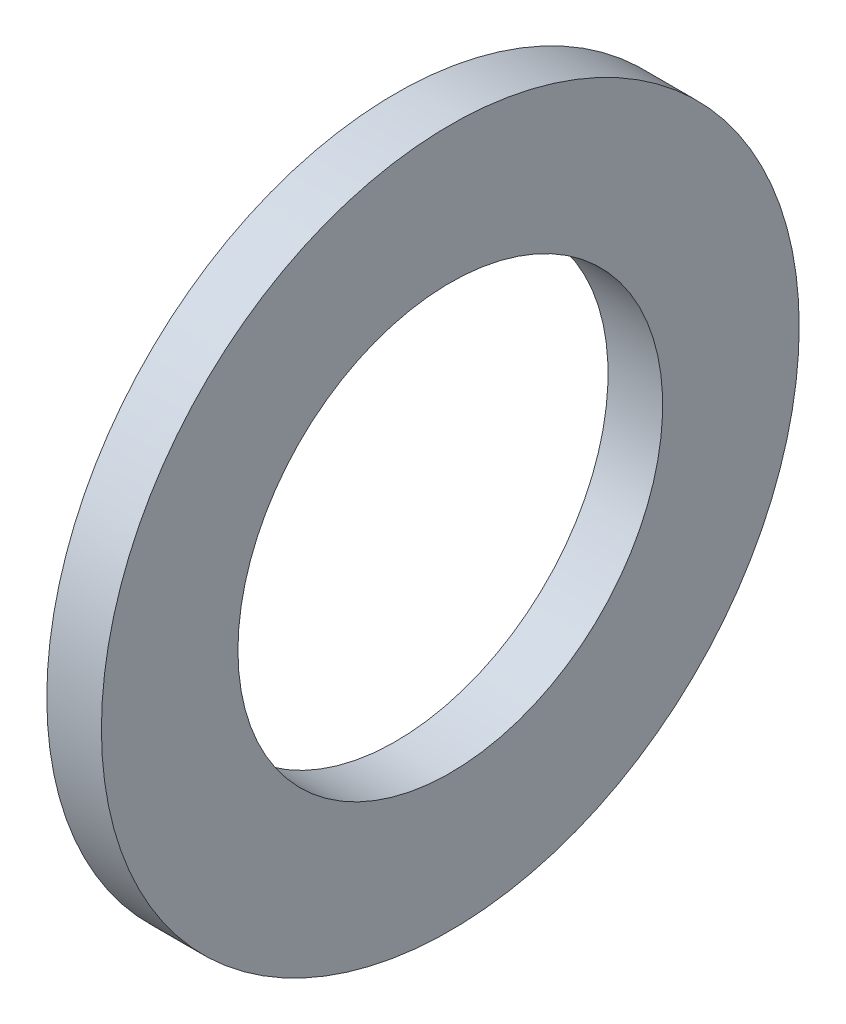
ISO-10303-21;
HEADER;
FILE_DESCRIPTION(('STEP AP214'),'2;1');
FILE_NAME('part.step','',(''),(''),'','','');
FILE_SCHEMA(('AUTOMOTIVE_DESIGN { 1 0 10303 214 1 1 1 1 }'));
ENDSEC;
DATA;
#1=APPLICATION_CONTEXT('core data for automotive mechanical design processes');
#2=APPLICATION_PROTOCOL_DEFINITION('international standard','automotive_design',2000,#1);
#3=PRODUCT_CONTEXT('',#1,'mechanical');
#4=PRODUCT('Part','Part','',(#3));
#5=PRODUCT_RELATED_PRODUCT_CATEGORY('part','',(#4));
#6=PRODUCT_DEFINITION_FORMATION('','',#4);
#7=PRODUCT_DEFINITION_CONTEXT('part definition',#1,'design');
#8=PRODUCT_DEFINITION('design','',#6,#7);
#9=PRODUCT_DEFINITION_SHAPE('','',#8);
#10=(LENGTH_UNIT() NAMED_UNIT(*) SI_UNIT(.MILLI.,.METRE.));
#11=(NAMED_UNIT(*) PLANE_ANGLE_UNIT() SI_UNIT($,.RADIAN.));
#12=(NAMED_UNIT(*) SI_UNIT($,.STERADIAN.) SOLID_ANGLE_UNIT());
#13=UNCERTAINTY_MEASURE_WITH_UNIT(LENGTH_MEASURE(1.E-05),#10,'distance_accuracy_value','');
#14=(GEOMETRIC_REPRESENTATION_CONTEXT(3) GLOBAL_UNCERTAINTY_ASSIGNED_CONTEXT((#13)) GLOBAL_UNIT_ASSIGNED_CONTEXT((#10,
#11,#12)) REPRESENTATION_CONTEXT('',''));
#15=CARTESIAN_POINT('',(0.,0.,0.));
#16=DIRECTION('',(0.,0.,1.));
#17=DIRECTION('',(1.,0.,0.));
#18=AXIS2_PLACEMENT_3D('',#15,#16,#17);
#19=CARTESIAN_POINT('',(-34.9249999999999,0.,0.));
#20=DIRECTION('',(-1.,0.,0.));
#21=DIRECTION('',(0.,0.,1.));
#22=AXIS2_PLACEMENT_3D('',#19,#20,#21);
#23=CYLINDRICAL_SURFACE('',#22,35.);
#24=CARTESIAN_POINT('',(0.,0.,0.));
#25=DIRECTION('',(-1.,0.,0.));
#26=DIRECTION('',(0.,0.,1.));
#27=AXIS2_PLACEMENT_3D('',#24,#25,#26);
#28=CIRCLE('',#27,35.);
#29=CARTESIAN_POINT('',(0.,0.,35.));
#30=VERTEX_POINT('',#29);
#31=EDGE_CURVE('E10',#30,#30,#28,.T.);
#32=ORIENTED_EDGE('',*,*,#31,.F.);
#33=EDGE_LOOP('',(#32));
#34=FACE_BOUND('',#33,.T.);
#35=CARTESIAN_POINT('',(-9.,0.,0.));
#36=DIRECTION('',(-1.,0.,0.));
#37=DIRECTION('',(0.,0.,1.));
#38=AXIS2_PLACEMENT_3D('',#35,#36,#37);
#39=CIRCLE('',#38,35.);
#40=CARTESIAN_POINT('',(-9.,0.,35.));
#41=VERTEX_POINT('',#40);
#42=EDGE_CURVE('E45',#41,#41,#39,.T.);
#43=ORIENTED_EDGE('',*,*,#42,.T.);
#44=EDGE_LOOP('',(#43));
#45=FACE_BOUND('',#44,.T.);
#46=ADVANCED_FACE('F31',(#34,#45),#23,.F.);
#47=CARTESIAN_POINT('',(0.,35.,0.));
#48=DIRECTION('',(-1.,0.,0.));
#49=DIRECTION('',(0.,0.,1.));
#50=AXIS2_PLACEMENT_3D('',#47,#48,#49);
#51=PLANE('',#50);
#52=CARTESIAN_POINT('',(0.,0.,0.));
#53=DIRECTION('',(-1.,0.,0.));
#54=DIRECTION('',(0.,0.,1.));
#55=AXIS2_PLACEMENT_3D('',#52,#53,#54);
#56=CIRCLE('',#55,57.5);
#57=CARTESIAN_POINT('',(0.,0.,57.5));
#58=VERTEX_POINT('',#57);
#59=EDGE_CURVE('E37',#58,#58,#56,.T.);
#60=ORIENTED_EDGE('',*,*,#59,.F.);
#61=EDGE_LOOP('',(#60));
#62=FACE_BOUND('',#61,.T.);
#63=ORIENTED_EDGE('',*,*,#31,.T.);
#64=EDGE_LOOP('',(#63));
#65=FACE_BOUND('',#64,.T.);
#66=ADVANCED_FACE('F60',(#62,#65),#51,.F.);
#67=CARTESIAN_POINT('',(-34.9249999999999,0.,0.));
#68=DIRECTION('',(-1.,0.,0.));
#69=DIRECTION('',(0.,0.,1.));
#70=AXIS2_PLACEMENT_3D('',#67,#68,#69);
#71=CYLINDRICAL_SURFACE('',#70,57.5);
#72=CARTESIAN_POINT('',(-9.,0.,0.));
#73=DIRECTION('',(-1.,0.,0.));
#74=DIRECTION('',(0.,0.,1.));
#75=AXIS2_PLACEMENT_3D('',#72,#73,#74);
#76=CIRCLE('',#75,57.5);
#77=CARTESIAN_POINT('',(-9.,0.,57.5));
#78=VERTEX_POINT('',#77);
#79=EDGE_CURVE('E41',#78,#78,#76,.T.);
#80=ORIENTED_EDGE('',*,*,#79,.F.);
#81=EDGE_LOOP('',(#80));
#82=FACE_BOUND('',#81,.T.);
#83=ORIENTED_EDGE('',*,*,#59,.T.);
#84=EDGE_LOOP('',(#83));
#85=FACE_BOUND('',#84,.T.);
#86=ADVANCED_FACE('F55',(#82,#85),#71,.T.);
#87=CARTESIAN_POINT('',(-9.,57.5,0.));
#88=DIRECTION('',(1.,0.,0.));
#89=DIRECTION('',(0.,0.,-1.));
#90=AXIS2_PLACEMENT_3D('',#87,#88,#89);
#91=PLANE('',#90);
#92=ORIENTED_EDGE('',*,*,#42,.F.);
#93=EDGE_LOOP('',(#92));
#94=FACE_BOUND('',#93,.T.);
#95=ORIENTED_EDGE('',*,*,#79,.T.);
#96=EDGE_LOOP('',(#95));
#97=FACE_BOUND('',#96,.T.);
#98=ADVANCED_FACE('F52',(#94,#97),#91,.F.);
#99=CLOSED_SHELL('',(#46,#66,#86,#98));
#100=MANIFOLD_SOLID_BREP('B2',#99);
#101=ADVANCED_BREP_SHAPE_REPRESENTATION('',(#18,#100),#14);
#102=SHAPE_DEFINITION_REPRESENTATION(#9,#101);
ENDSEC;
END-ISO-10303-21;
